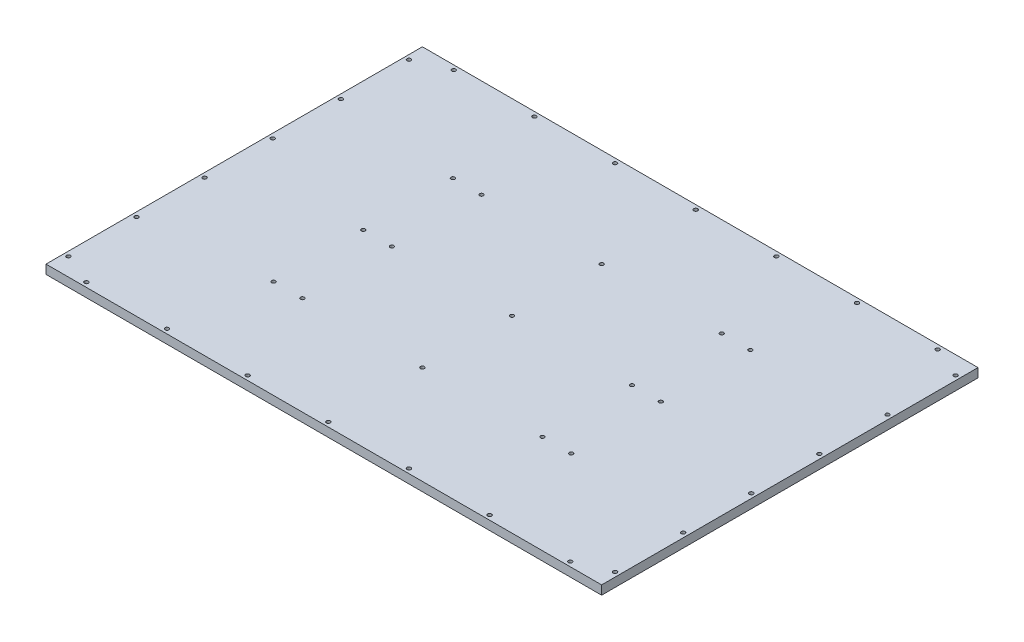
from build123d import *

# Parameters (mm, degrees)
SKETCH_1_W              = 620
SKETCH_1_H              = 420
EXTRUDE_1_DEPTH         = 10
HOLE_WIZARD_4_3_4_3_1_D = 4.3
HOLE_WIZARD_M51_D       = 4.2
HOLE_WIZARD_M51_DEPTH   = 10
HOLE_WIZARD_M51_TIP     = 1.2618073


with BuildPart() as part:
    # Sketch 1 → Extrude 1 (new body)
    with BuildSketch(Plane(origin=(0, 0, 0), x_dir=(1, 0, 0), z_dir=(0, 1, 0))):
        Rectangle(SKETCH_1_W, SKETCH_1_H)
    extrude(amount=EXTRUDE_1_DEPTH)

    # Hole Wizard 4.3 _4.3_1 (through all)
    with Locations(Plane(origin=(1.472976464, 0, 2.937580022), x_dir=(1, 0, 0), z_dir=(0, -1, 0))):
        with Locations((303.527023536, 187.062419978), (303.527023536, 111.062419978), (303.527023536, 35.062419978), (303.527023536, -40.937580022), (178.527023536, 202.062419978), (88.527023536, 202.062419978), (-1.472976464, 202.062419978), (-91.472976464, 202.062419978), (268.527023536, 202.062419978), (-181.472976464, 202.062419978), (-271.472976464, 202.062419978), (-306.472976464, 187.062419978), (-306.472976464, 111.062419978), (-306.472976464, 35.062419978), (-306.472976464, -40.937580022), (-306.472976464, -116.937580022), (-306.472976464, -192.937580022), (-271.472976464, -207.937580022), (-181.472976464, -207.937580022), (-91.472976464, -207.937580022), (-1.472976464, -207.937580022), (88.527023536, -207.937580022), (178.527023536, -207.937580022), (268.527023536, -207.937580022), (303.527023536, -192.937580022), (303.527023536, -116.937580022)):
            Hole(HOLE_WIZARD_4_3_4_3_1_D / 2)

    # Hole Wizard M51
    with Locations(Plane(origin=(0, 10, 0), x_dir=(1, 0, 0), z_dir=(0, 1, 0))):
        with Locations((166, 100), (166, 0), (166, -100), (134, -100), (134, 0), (134, 100), (0, 100), (0, 0), (0, -100), (-134, -100), (-134, 0), (-134, 100), (-166, 100), (-166, 0), (-166, -100)):
            Hole(HOLE_WIZARD_M51_D / 2, depth=HOLE_WIZARD_M51_DEPTH)
            with Locations((0, 0, -(HOLE_WIZARD_M51_DEPTH + HOLE_WIZARD_M51_TIP / 2))):  # 118° drill point
                Cone(0, HOLE_WIZARD_M51_D / 2, HOLE_WIZARD_M51_TIP, mode=Mode.SUBTRACT)


solid = part.part
